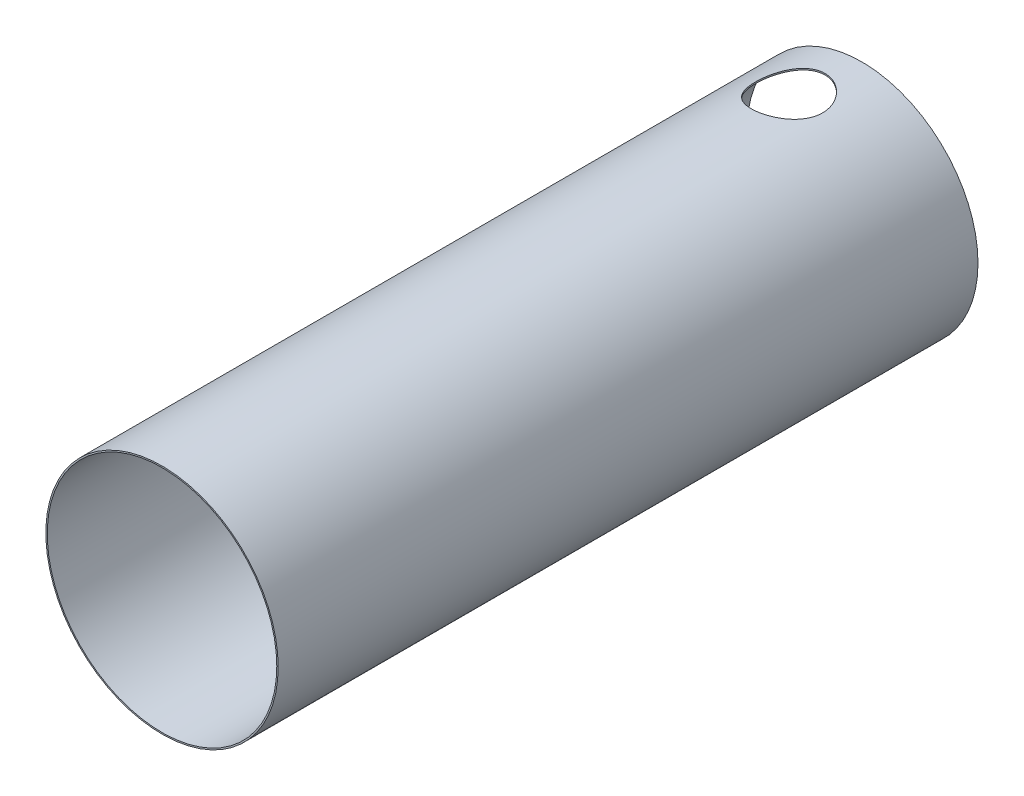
from build123d import *

# Parameters (mm, degrees)
SKETCH1_R          = 20.75
SKETCH1_R_2        = 20.5
EXTRUDE1_DEPTH     = 125
SKETCH2_R          = 6
CUT_EXTRUDE1_DEPTH = 129.398306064


with BuildPart() as part:
    # Sketch1 → Extrude1 (new body)
    with BuildSketch(Plane.XY):
        Circle(SKETCH1_R)
        Circle(SKETCH1_R_2, mode=Mode.SUBTRACT)
    extrude(amount=EXTRUDE1_DEPTH)

    # Sketch2 → Cut-Extrude1 (cut, through all)
    with BuildSketch(Plane(origin=(0, 0, 0), x_dir=(1, 0, 0), z_dir=(0, 1, 0))):
        with Locations(Location((-2, -11, 0), (0, 0, 90))):
            Circle(SKETCH2_R)
    extrude(amount=CUT_EXTRUDE1_DEPTH, mode=Mode.SUBTRACT)


solid = part.part
